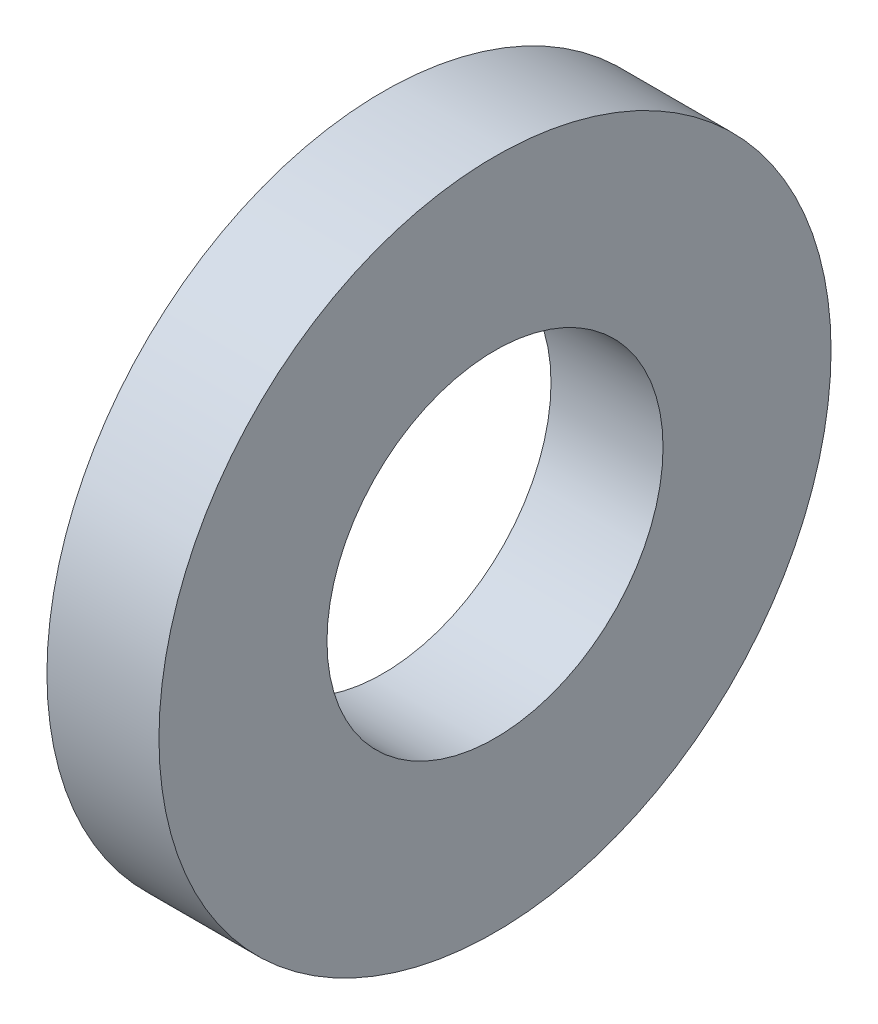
ISO-10303-21;
HEADER;
FILE_DESCRIPTION(('STEP AP214'),'2;1');
FILE_NAME('part.step','',(''),(''),'','','');
FILE_SCHEMA(('AUTOMOTIVE_DESIGN { 1 0 10303 214 1 1 1 1 }'));
ENDSEC;
DATA;
#1=APPLICATION_CONTEXT('core data for automotive mechanical design processes');
#2=APPLICATION_PROTOCOL_DEFINITION('international standard','automotive_design',2000,#1);
#3=PRODUCT_CONTEXT('',#1,'mechanical');
#4=PRODUCT('Part','Part','',(#3));
#5=PRODUCT_RELATED_PRODUCT_CATEGORY('part','',(#4));
#6=PRODUCT_DEFINITION_FORMATION('','',#4);
#7=PRODUCT_DEFINITION_CONTEXT('part definition',#1,'design');
#8=PRODUCT_DEFINITION('design','',#6,#7);
#9=PRODUCT_DEFINITION_SHAPE('','',#8);
#10=(LENGTH_UNIT() NAMED_UNIT(*) SI_UNIT(.MILLI.,.METRE.));
#11=(NAMED_UNIT(*) PLANE_ANGLE_UNIT() SI_UNIT($,.RADIAN.));
#12=(NAMED_UNIT(*) SI_UNIT($,.STERADIAN.) SOLID_ANGLE_UNIT());
#13=UNCERTAINTY_MEASURE_WITH_UNIT(LENGTH_MEASURE(1.E-05),#10,'distance_accuracy_value','');
#14=(GEOMETRIC_REPRESENTATION_CONTEXT(3) GLOBAL_UNCERTAINTY_ASSIGNED_CONTEXT((#13)) GLOBAL_UNIT_ASSIGNED_CONTEXT((#10,
#11,#12)) REPRESENTATION_CONTEXT('',''));
#15=CARTESIAN_POINT('',(0.,0.,0.));
#16=DIRECTION('',(0.,0.,1.));
#17=DIRECTION('',(1.,0.,0.));
#18=AXIS2_PLACEMENT_3D('',#15,#16,#17);
#19=CARTESIAN_POINT('',(4.4958,0.,0.));
#20=DIRECTION('',(1.,0.,0.));
#21=DIRECTION('',(0.,0.,-1.));
#22=AXIS2_PLACEMENT_3D('',#19,#20,#21);
#23=PLANE('',#22);
#24=CARTESIAN_POINT('',(4.4958,0.,0.));
#25=DIRECTION('',(1.,0.,0.));
#26=DIRECTION('',(0.,0.,-1.));
#27=AXIS2_PLACEMENT_3D('',#24,#25,#26);
#28=CIRCLE('',#27,13.4874);
#29=CARTESIAN_POINT('',(4.4958,0.,-13.4874));
#30=VERTEX_POINT('',#29);
#31=EDGE_CURVE('E10',#30,#30,#28,.T.);
#32=ORIENTED_EDGE('',*,*,#31,.T.);
#33=EDGE_LOOP('',(#32));
#34=FACE_BOUND('',#33,.T.);
#35=CARTESIAN_POINT('',(4.4958,0.,0.));
#36=DIRECTION('',(1.,0.,0.));
#37=DIRECTION('',(0.,0.,-1.));
#38=AXIS2_PLACEMENT_3D('',#35,#36,#37);
#39=CIRCLE('',#38,6.7437);
#40=CARTESIAN_POINT('',(4.4958,0.,-6.7437));
#41=VERTEX_POINT('',#40);
#42=EDGE_CURVE('E43',#41,#41,#39,.T.);
#43=ORIENTED_EDGE('',*,*,#42,.F.);
#44=EDGE_LOOP('',(#43));
#45=FACE_BOUND('',#44,.T.);
#46=ADVANCED_FACE('F32',(#34,#45),#23,.T.);
#47=CARTESIAN_POINT('',(0.,0.,0.));
#48=DIRECTION('',(1.,0.,0.));
#49=DIRECTION('',(0.,0.,-1.));
#50=AXIS2_PLACEMENT_3D('',#47,#48,#49);
#51=PLANE('',#50);
#52=CARTESIAN_POINT('',(0.,0.,0.));
#53=DIRECTION('',(1.,0.,0.));
#54=DIRECTION('',(0.,0.,-1.));
#55=AXIS2_PLACEMENT_3D('',#52,#53,#54);
#56=CIRCLE('',#55,13.4874);
#57=CARTESIAN_POINT('',(0.,0.,-13.4874));
#58=VERTEX_POINT('',#57);
#59=EDGE_CURVE('E36',#58,#58,#56,.T.);
#60=ORIENTED_EDGE('',*,*,#59,.F.);
#61=EDGE_LOOP('',(#60));
#62=FACE_BOUND('',#61,.T.);
#63=CARTESIAN_POINT('',(0.,0.,0.));
#64=DIRECTION('',(1.,0.,0.));
#65=DIRECTION('',(0.,0.,-1.));
#66=AXIS2_PLACEMENT_3D('',#63,#64,#65);
#67=CIRCLE('',#66,6.7437);
#68=CARTESIAN_POINT('',(0.,0.,-6.7437));
#69=VERTEX_POINT('',#68);
#70=EDGE_CURVE('E45',#69,#69,#67,.T.);
#71=ORIENTED_EDGE('',*,*,#70,.T.);
#72=EDGE_LOOP('',(#71));
#73=FACE_BOUND('',#72,.T.);
#74=ADVANCED_FACE('F55',(#62,#73),#51,.F.);
#75=CARTESIAN_POINT('',(4.4958,0.,0.));
#76=DIRECTION('',(-1.,0.,0.));
#77=DIRECTION('',(0.,0.,1.));
#78=AXIS2_PLACEMENT_3D('',#75,#76,#77);
#79=CYLINDRICAL_SURFACE('',#78,13.4874);
#80=ORIENTED_EDGE('',*,*,#31,.F.);
#81=EDGE_LOOP('',(#80));
#82=FACE_BOUND('',#81,.T.);
#83=ORIENTED_EDGE('',*,*,#59,.T.);
#84=EDGE_LOOP('',(#83));
#85=FACE_BOUND('',#84,.T.);
#86=ADVANCED_FACE('F34',(#82,#85),#79,.T.);
#87=CARTESIAN_POINT('',(4.4958,0.,0.));
#88=DIRECTION('',(-1.,0.,0.));
#89=DIRECTION('',(0.,0.,1.));
#90=AXIS2_PLACEMENT_3D('',#87,#88,#89);
#91=CYLINDRICAL_SURFACE('',#90,6.7437);
#92=ORIENTED_EDGE('',*,*,#42,.T.);
#93=EDGE_LOOP('',(#92));
#94=FACE_BOUND('',#93,.T.);
#95=ORIENTED_EDGE('',*,*,#70,.F.);
#96=EDGE_LOOP('',(#95));
#97=FACE_BOUND('',#96,.T.);
#98=ADVANCED_FACE('F51',(#94,#97),#91,.F.);
#99=CLOSED_SHELL('',(#46,#74,#86,#98));
#100=MANIFOLD_SOLID_BREP('B2',#99);
#101=ADVANCED_BREP_SHAPE_REPRESENTATION('',(#18,#100),#14);
#102=SHAPE_DEFINITION_REPRESENTATION(#9,#101);
ENDSEC;
END-ISO-10303-21;
